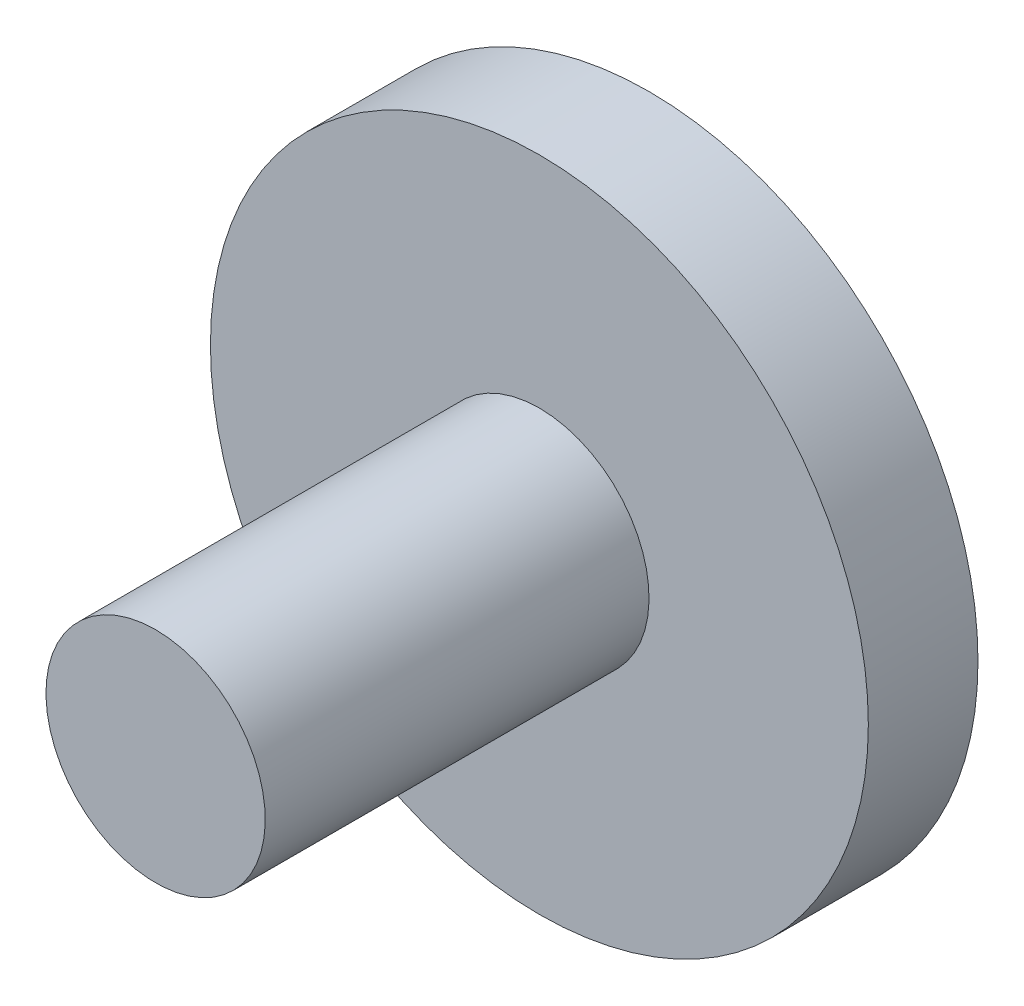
ISO-10303-21;
HEADER;
FILE_DESCRIPTION(('STEP AP214'),'2;1');
FILE_NAME('part.step','',(''),(''),'','','');
FILE_SCHEMA(('AUTOMOTIVE_DESIGN { 1 0 10303 214 1 1 1 1 }'));
ENDSEC;
DATA;
#1=APPLICATION_CONTEXT('core data for automotive mechanical design processes');
#2=APPLICATION_PROTOCOL_DEFINITION('international standard','automotive_design',2000,#1);
#3=PRODUCT_CONTEXT('',#1,'mechanical');
#4=PRODUCT('Part','Part','',(#3));
#5=PRODUCT_RELATED_PRODUCT_CATEGORY('part','',(#4));
#6=PRODUCT_DEFINITION_FORMATION('','',#4);
#7=PRODUCT_DEFINITION_CONTEXT('part definition',#1,'design');
#8=PRODUCT_DEFINITION('design','',#6,#7);
#9=PRODUCT_DEFINITION_SHAPE('','',#8);
#10=(LENGTH_UNIT() NAMED_UNIT(*) SI_UNIT(.MILLI.,.METRE.));
#11=(NAMED_UNIT(*) PLANE_ANGLE_UNIT() SI_UNIT($,.RADIAN.));
#12=(NAMED_UNIT(*) SI_UNIT($,.STERADIAN.) SOLID_ANGLE_UNIT());
#13=UNCERTAINTY_MEASURE_WITH_UNIT(LENGTH_MEASURE(1.E-05),#10,'distance_accuracy_value','');
#14=(GEOMETRIC_REPRESENTATION_CONTEXT(3) GLOBAL_UNCERTAINTY_ASSIGNED_CONTEXT((#13)) GLOBAL_UNIT_ASSIGNED_CONTEXT((#10,
#11,#12)) REPRESENTATION_CONTEXT('',''));
#15=CARTESIAN_POINT('',(0.,0.,0.));
#16=DIRECTION('',(0.,0.,1.));
#17=DIRECTION('',(1.,0.,0.));
#18=AXIS2_PLACEMENT_3D('',#15,#16,#17);
#19=CARTESIAN_POINT('',(0.,14.9962595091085,-45.));
#20=DIRECTION('',(0.,0.,1.));
#21=DIRECTION('',(0.,-1.,0.));
#22=AXIS2_PLACEMENT_3D('',#19,#20,#21);
#23=PLANE('',#22);
#24=CARTESIAN_POINT('',(0.,0.,-45.));
#25=DIRECTION('',(0.,0.,-1.));
#26=DIRECTION('',(0.,1.,0.));
#27=AXIS2_PLACEMENT_3D('',#24,#25,#26);
#28=CIRCLE('',#27,30.);
#29=CARTESIAN_POINT('',(0.,30.,-45.));
#30=VERTEX_POINT('',#29);
#31=EDGE_CURVE('E10',#30,#30,#28,.T.);
#32=ORIENTED_EDGE('',*,*,#31,.T.);
#33=EDGE_LOOP('',(#32));
#34=FACE_BOUND('',#33,.T.);
#35=ADVANCED_FACE('F32',(#34),#23,.F.);
#36=CARTESIAN_POINT('',(0.,0.,-45.));
#37=DIRECTION('',(0.,0.,-1.));
#38=DIRECTION('',(0.,1.,0.));
#39=AXIS2_PLACEMENT_3D('',#36,#37,#38);
#40=CYLINDRICAL_SURFACE('',#39,30.);
#41=ORIENTED_EDGE('',*,*,#31,.F.);
#42=EDGE_LOOP('',(#41));
#43=FACE_BOUND('',#42,.T.);
#44=CARTESIAN_POINT('',(0.,0.,-35.));
#45=DIRECTION('',(0.,0.,-1.));
#46=DIRECTION('',(0.,1.,0.));
#47=AXIS2_PLACEMENT_3D('',#44,#45,#46);
#48=CIRCLE('',#47,30.);
#49=CARTESIAN_POINT('',(0.,30.,-35.));
#50=VERTEX_POINT('',#49);
#51=EDGE_CURVE('E38',#50,#50,#48,.T.);
#52=ORIENTED_EDGE('',*,*,#51,.T.);
#53=EDGE_LOOP('',(#52));
#54=FACE_BOUND('',#53,.T.);
#55=ADVANCED_FACE('F64',(#43,#54),#40,.T.);
#56=CARTESIAN_POINT('',(0.,14.9962595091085,-35.));
#57=DIRECTION('',(0.,0.,-1.));
#58=DIRECTION('',(0.,1.,0.));
#59=AXIS2_PLACEMENT_3D('',#56,#57,#58);
#60=PLANE('',#59);
#61=ORIENTED_EDGE('',*,*,#51,.F.);
#62=EDGE_LOOP('',(#61));
#63=FACE_BOUND('',#62,.T.);
#64=CARTESIAN_POINT('',(0.,0.,-35.));
#65=DIRECTION('',(0.,0.,-1.));
#66=DIRECTION('',(0.,1.,0.));
#67=AXIS2_PLACEMENT_3D('',#64,#65,#66);
#68=CIRCLE('',#67,10.);
#69=CARTESIAN_POINT('',(0.,10.,-35.));
#70=VERTEX_POINT('',#69);
#71=EDGE_CURVE('E42',#70,#70,#68,.T.);
#72=ORIENTED_EDGE('',*,*,#71,.T.);
#73=EDGE_LOOP('',(#72));
#74=FACE_BOUND('',#73,.T.);
#75=ADVANCED_FACE('F60',(#63,#74),#60,.F.);
#76=CARTESIAN_POINT('',(0.,0.,-45.));
#77=DIRECTION('',(0.,0.,-1.));
#78=DIRECTION('',(0.,1.,0.));
#79=AXIS2_PLACEMENT_3D('',#76,#77,#78);
#80=CYLINDRICAL_SURFACE('',#79,10.);
#81=ORIENTED_EDGE('',*,*,#71,.F.);
#82=EDGE_LOOP('',(#81));
#83=FACE_BOUND('',#82,.T.);
#84=CARTESIAN_POINT('',(0.,0.,0.));
#85=DIRECTION('',(0.,0.,-1.));
#86=DIRECTION('',(0.,1.,0.));
#87=AXIS2_PLACEMENT_3D('',#84,#85,#86);
#88=CIRCLE('',#87,10.);
#89=CARTESIAN_POINT('',(0.,10.,0.));
#90=VERTEX_POINT('',#89);
#91=EDGE_CURVE('E46',#90,#90,#88,.T.);
#92=ORIENTED_EDGE('',*,*,#91,.T.);
#93=EDGE_LOOP('',(#92));
#94=FACE_BOUND('',#93,.T.);
#95=ADVANCED_FACE('F52',(#83,#94),#80,.T.);
#96=CARTESIAN_POINT('',(0.,14.9962595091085,0.));
#97=DIRECTION('',(0.,0.,-1.));
#98=DIRECTION('',(0.,1.,0.));
#99=AXIS2_PLACEMENT_3D('',#96,#97,#98);
#100=PLANE('',#99);
#101=ORIENTED_EDGE('',*,*,#91,.F.);
#102=EDGE_LOOP('',(#101));
#103=FACE_BOUND('',#102,.T.);
#104=ADVANCED_FACE('F54',(#103),#100,.F.);
#105=CLOSED_SHELL('',(#35,#55,#75,#95,#104));
#106=MANIFOLD_SOLID_BREP('B2',#105);
#107=ADVANCED_BREP_SHAPE_REPRESENTATION('',(#18,#106),#14);
#108=SHAPE_DEFINITION_REPRESENTATION(#9,#107);
ENDSEC;
END-ISO-10303-21;
